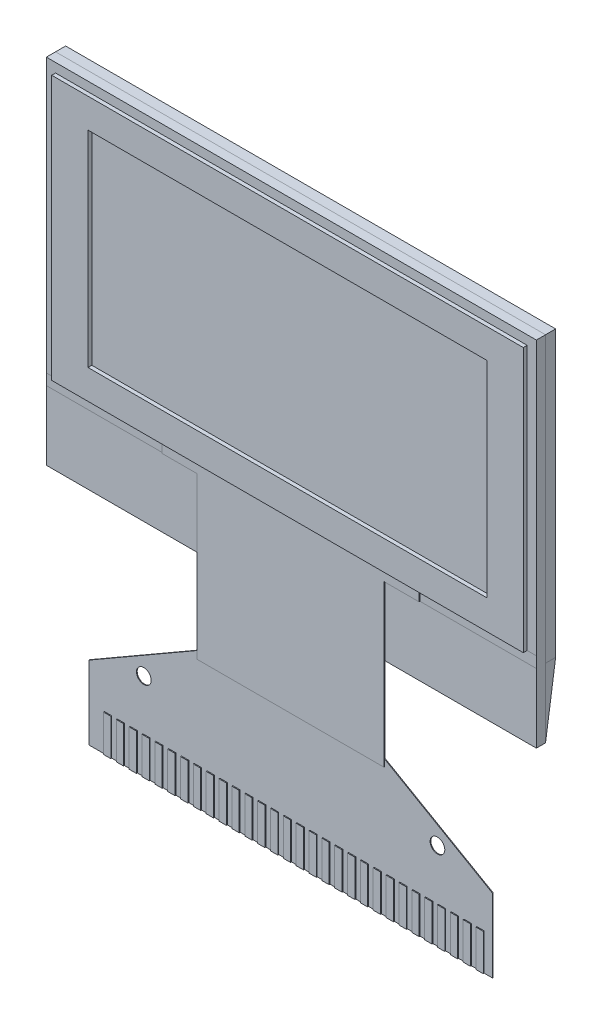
from build123d import *

# Parameters (mm, degrees)
SKETCH1_W              = 26.7
SKETCH1_H              = 19.26
BOSS_EXTRUDE2_DEPTH    = 0.5
SKETCH2_R              = 0.4
BOSS_EXTRUDE3_DEPTH    = 0.04
BOSS_EXTRUDE5_DEPTH    = 0.05
SKETCH3_W              = 0.4
SKETCH3_H              = 2
BOSS_EXTRUDE4_DEPTH    = 0.05
BOSS_EXTRUDE4_2_DEPTH  = 0.05
BOSS_EXTRUDE4_3_DEPTH  = 0.05
BOSS_EXTRUDE4_4_DEPTH  = 0.05
BOSS_EXTRUDE4_5_DEPTH  = 0.05
BOSS_EXTRUDE4_6_DEPTH  = 0.05
BOSS_EXTRUDE4_7_DEPTH  = 0.05
BOSS_EXTRUDE4_8_DEPTH  = 0.05
BOSS_EXTRUDE4_9_DEPTH  = 0.05
BOSS_EXTRUDE4_10_DEPTH = 0.05
BOSS_EXTRUDE4_11_DEPTH = 0.05
BOSS_EXTRUDE4_12_DEPTH = 0.05
BOSS_EXTRUDE4_13_DEPTH = 0.05
BOSS_EXTRUDE4_14_DEPTH = 0.05
BOSS_EXTRUDE4_15_DEPTH = 0.05
BOSS_EXTRUDE4_16_DEPTH = 0.05
BOSS_EXTRUDE4_17_DEPTH = 0.05
BOSS_EXTRUDE4_18_DEPTH = 0.05
BOSS_EXTRUDE4_19_DEPTH = 0.05
BOSS_EXTRUDE4_20_DEPTH = 0.05
BOSS_EXTRUDE4_21_DEPTH = 0.05
BOSS_EXTRUDE4_22_DEPTH = 0.05
BOSS_EXTRUDE4_23_DEPTH = 0.05
BOSS_EXTRUDE4_24_DEPTH = 0.05
BOSS_EXTRUDE4_25_DEPTH = 0.05
BOSS_EXTRUDE4_26_DEPTH = 0.05
BOSS_EXTRUDE4_27_DEPTH = 0.05
BOSS_EXTRUDE4_28_DEPTH = 0.05
BOSS_EXTRUDE4_29_DEPTH = 0.05
BOSS_EXTRUDE4_30_DEPTH = 0.05
BOSS_EXTRUDE6_START    = 0.5
SKETCH1_6_W            = 25.7
SKETCH1_6_H            = 14.4
SKETCH1_6_W_2          = 21.744
SKETCH1_6_H_2          = 11.204
BOSS_EXTRUDE6_DEPTH    = 0.21
SKETCH1_7_W            = 25.7
SKETCH1_7_H            = 14.4
SKETCH1_7_W_2          = 23.744
SKETCH1_7_H_2          = 13.204
SKETCH1_7_W_3          = 21.744
SKETCH1_7_H_3          = 11.204
BOSS_EXTRUDE7_DEPTH    = 0.55
BOSS_EXTRUDE8_DEPTH    = 26.7


with BuildPart() as part:
    # Sketch1 → Boss-Extrude2 (new body)
    with BuildSketch(Plane.XY):
        with Locations((0, -1.93)):
            Rectangle(SKETCH1_W, SKETCH1_H)
    extrude(amount=BOSS_EXTRUDE2_DEPTH)


with BuildPart() as body_2:
    # Sketch2 → Boss-Extrude3 (new body)
    with BuildSketch(Plane.XY.offset(0.5)):
        Polygon((-5.105, -11.06), (-5.105, -16.16), (-11, -19.56), (-11, -23.56), (11, -23.56), (11, -19.56), (5.105, -16.16), (5.105, -11.06), align=None)
        with Locations((-8, -18.81)):
            Circle(SKETCH2_R, mode=Mode.SUBTRACT)
        with Locations((8, -18.81)):
            Circle(SKETCH2_R, mode=Mode.SUBTRACT)
    extrude(amount=BOSS_EXTRUDE3_DEPTH)


with BuildPart() as body_3:
    # Sketch4 → Boss-Extrude5 (new body)
    with BuildSketch(Plane.XY.offset(0.5)):
        Polygon((-7, -7.2), (7, -7.2), (7, -7.8), (5.105, -7.8), (5.105, -16.56), (-5.105, -16.56), (-5.105, -7.8), (-7, -7.8), align=None)
    extrude(amount=BOSS_EXTRUDE5_DEPTH)


with BuildPart() as body_4:
    # Sketch3 → Boss-Extrude4 (new body)
    with BuildSketch(Plane.XY.offset(0.54)):
        with Locations((-9.95, -22.56)):
            Rectangle(SKETCH3_W, SKETCH3_H)
    extrude(amount=BOSS_EXTRUDE4_DEPTH)


with BuildPart() as body_5:
    # Sketch3 → Boss-Extrude4 2 (new body)
    with BuildSketch(Plane.XY.offset(0.54)):
        with Locations((-9.25, -22.56)):
            Rectangle(SKETCH3_W, SKETCH3_H)
    extrude(amount=BOSS_EXTRUDE4_2_DEPTH)


with BuildPart() as body_6:
    # Sketch3 → Boss-Extrude4 3 (new body)
    with BuildSketch(Plane.XY.offset(0.54)):
        with Locations((-8.55, -22.56)):
            Rectangle(SKETCH3_W, SKETCH3_H)
    extrude(amount=BOSS_EXTRUDE4_3_DEPTH)


with BuildPart() as body_7:
    # Sketch3 → Boss-Extrude4 4 (new body)
    with BuildSketch(Plane.XY.offset(0.54)):
        with Locations((-7.85, -22.56)):
            Rectangle(SKETCH3_W, SKETCH3_H)
    extrude(amount=BOSS_EXTRUDE4_4_DEPTH)


with BuildPart() as body_8:
    # Sketch3 → Boss-Extrude4 5 (new body)
    with BuildSketch(Plane.XY.offset(0.54)):
        with Locations((-7.15, -22.56)):
            Rectangle(SKETCH3_W, SKETCH3_H)
    extrude(amount=BOSS_EXTRUDE4_5_DEPTH)


with BuildPart() as body_9:
    # Sketch3 → Boss-Extrude4 6 (new body)
    with BuildSketch(Plane.XY.offset(0.54)):
        with Locations((-6.45, -22.56)):
            Rectangle(SKETCH3_W, SKETCH3_H)
    extrude(amount=BOSS_EXTRUDE4_6_DEPTH)


with BuildPart() as body_10:
    # Sketch3 → Boss-Extrude4 7 (new body)
    with BuildSketch(Plane.XY.offset(0.54)):
        with Locations((-5.75, -22.56)):
            Rectangle(SKETCH3_W, SKETCH3_H)
    extrude(amount=BOSS_EXTRUDE4_7_DEPTH)


with BuildPart() as body_11:
    # Sketch3 → Boss-Extrude4 8 (new body)
    with BuildSketch(Plane.XY.offset(0.54)):
        with Locations((-5.05, -22.56)):
            Rectangle(SKETCH3_W, SKETCH3_H)
    extrude(amount=BOSS_EXTRUDE4_8_DEPTH)


with BuildPart() as body_12:
    # Sketch3 → Boss-Extrude4 9 (new body)
    with BuildSketch(Plane.XY.offset(0.54)):
        with Locations((-4.35, -22.56)):
            Rectangle(SKETCH3_W, SKETCH3_H)
    extrude(amount=BOSS_EXTRUDE4_9_DEPTH)


with BuildPart() as body_13:
    # Sketch3 → Boss-Extrude4 10 (new body)
    with BuildSketch(Plane.XY.offset(0.54)):
        with Locations((-3.65, -22.56)):
            Rectangle(SKETCH3_W, SKETCH3_H)
    extrude(amount=BOSS_EXTRUDE4_10_DEPTH)


with BuildPart() as body_14:
    # Sketch3 → Boss-Extrude4 11 (new body)
    with BuildSketch(Plane.XY.offset(0.54)):
        with Locations((-2.95, -22.56)):
            Rectangle(SKETCH3_W, SKETCH3_H)
    extrude(amount=BOSS_EXTRUDE4_11_DEPTH)


with BuildPart() as body_15:
    # Sketch3 → Boss-Extrude4 12 (new body)
    with BuildSketch(Plane.XY.offset(0.54)):
        with Locations((-2.25, -22.56)):
            Rectangle(SKETCH3_W, SKETCH3_H)
    extrude(amount=BOSS_EXTRUDE4_12_DEPTH)


with BuildPart() as body_16:
    # Sketch3 → Boss-Extrude4 13 (new body)
    with BuildSketch(Plane.XY.offset(0.54)):
        with Locations((-1.55, -22.56)):
            Rectangle(SKETCH3_W, SKETCH3_H)
    extrude(amount=BOSS_EXTRUDE4_13_DEPTH)


with BuildPart() as body_17:
    # Sketch3 → Boss-Extrude4 14 (new body)
    with BuildSketch(Plane.XY.offset(0.54)):
        with Locations((-0.85, -22.56)):
            Rectangle(SKETCH3_W, SKETCH3_H)
    extrude(amount=BOSS_EXTRUDE4_14_DEPTH)


with BuildPart() as body_18:
    # Sketch3 → Boss-Extrude4 15 (new body)
    with BuildSketch(Plane.XY.offset(0.54)):
        with Locations((-0.15, -22.56)):
            Rectangle(SKETCH3_W, SKETCH3_H)
    extrude(amount=BOSS_EXTRUDE4_15_DEPTH)


with BuildPart() as body_19:
    # Sketch3 → Boss-Extrude4 16 (new body)
    with BuildSketch(Plane.XY.offset(0.54)):
        with Locations((0.55, -22.56)):
            Rectangle(SKETCH3_W, SKETCH3_H)
    extrude(amount=BOSS_EXTRUDE4_16_DEPTH)


with BuildPart() as body_20:
    # Sketch3 → Boss-Extrude4 17 (new body)
    with BuildSketch(Plane.XY.offset(0.54)):
        with Locations((1.25, -22.56)):
            Rectangle(SKETCH3_W, SKETCH3_H)
    extrude(amount=BOSS_EXTRUDE4_17_DEPTH)


with BuildPart() as body_21:
    # Sketch3 → Boss-Extrude4 18 (new body)
    with BuildSketch(Plane.XY.offset(0.54)):
        with Locations((1.95, -22.56)):
            Rectangle(SKETCH3_W, SKETCH3_H)
    extrude(amount=BOSS_EXTRUDE4_18_DEPTH)


with BuildPart() as body_22:
    # Sketch3 → Boss-Extrude4 19 (new body)
    with BuildSketch(Plane.XY.offset(0.54)):
        with Locations((2.65, -22.56)):
            Rectangle(SKETCH3_W, SKETCH3_H)
    extrude(amount=BOSS_EXTRUDE4_19_DEPTH)


with BuildPart() as body_23:
    # Sketch3 → Boss-Extrude4 20 (new body)
    with BuildSketch(Plane.XY.offset(0.54)):
        with Locations((3.35, -22.56)):
            Rectangle(SKETCH3_W, SKETCH3_H)
    extrude(amount=BOSS_EXTRUDE4_20_DEPTH)


with BuildPart() as body_24:
    # Sketch3 → Boss-Extrude4 21 (new body)
    with BuildSketch(Plane.XY.offset(0.54)):
        with Locations((4.05, -22.56)):
            Rectangle(SKETCH3_W, SKETCH3_H)
    extrude(amount=BOSS_EXTRUDE4_21_DEPTH)


with BuildPart() as body_25:
    # Sketch3 → Boss-Extrude4 22 (new body)
    with BuildSketch(Plane.XY.offset(0.54)):
        with Locations((4.75, -22.56)):
            Rectangle(SKETCH3_W, SKETCH3_H)
    extrude(amount=BOSS_EXTRUDE4_22_DEPTH)


with BuildPart() as body_26:
    # Sketch3 → Boss-Extrude4 23 (new body)
    with BuildSketch(Plane.XY.offset(0.54)):
        with Locations((5.45, -22.56)):
            Rectangle(SKETCH3_W, SKETCH3_H)
    extrude(amount=BOSS_EXTRUDE4_23_DEPTH)


with BuildPart() as body_27:
    # Sketch3 → Boss-Extrude4 24 (new body)
    with BuildSketch(Plane.XY.offset(0.54)):
        with Locations((6.15, -22.56)):
            Rectangle(SKETCH3_W, SKETCH3_H)
    extrude(amount=BOSS_EXTRUDE4_24_DEPTH)


with BuildPart() as body_28:
    # Sketch3 → Boss-Extrude4 25 (new body)
    with BuildSketch(Plane.XY.offset(0.54)):
        with Locations((6.85, -22.56)):
            Rectangle(SKETCH3_W, SKETCH3_H)
    extrude(amount=BOSS_EXTRUDE4_25_DEPTH)


with BuildPart() as body_29:
    # Sketch3 → Boss-Extrude4 26 (new body)
    with BuildSketch(Plane.XY.offset(0.54)):
        with Locations((7.55, -22.56)):
            Rectangle(SKETCH3_W, SKETCH3_H)
    extrude(amount=BOSS_EXTRUDE4_26_DEPTH)


with BuildPart() as body_30:
    # Sketch3 → Boss-Extrude4 27 (new body)
    with BuildSketch(Plane.XY.offset(0.54)):
        with Locations((8.25, -22.56)):
            Rectangle(SKETCH3_W, SKETCH3_H)
    extrude(amount=BOSS_EXTRUDE4_27_DEPTH)


with BuildPart() as body_31:
    # Sketch3 → Boss-Extrude4 28 (new body)
    with BuildSketch(Plane.XY.offset(0.54)):
        with Locations((8.95, -22.56)):
            Rectangle(SKETCH3_W, SKETCH3_H)
    extrude(amount=BOSS_EXTRUDE4_28_DEPTH)


with BuildPart() as body_32:
    # Sketch3 → Boss-Extrude4 29 (new body)
    with BuildSketch(Plane.XY.offset(0.54)):
        with Locations((9.65, -22.56)):
            Rectangle(SKETCH3_W, SKETCH3_H)
    extrude(amount=BOSS_EXTRUDE4_29_DEPTH)


with BuildPart() as body_33:
    # Sketch3 → Boss-Extrude4 30 (new body)
    with BuildSketch(Plane.XY.offset(0.54)):
        with Locations((10.35, -22.56)):
            Rectangle(SKETCH3_W, SKETCH3_H)
    extrude(amount=BOSS_EXTRUDE4_30_DEPTH)


with BuildPart() as body_34:
    # Sketch1_6 → Boss-Extrude6 (new body)
    with BuildSketch(Plane.XY.offset(BOSS_EXTRUDE6_START)):
        Rectangle(SKETCH1_6_W, SKETCH1_6_H)
        Rectangle(SKETCH1_6_W_2, SKETCH1_6_H_2, mode=Mode.SUBTRACT)
    extrude(amount=BOSS_EXTRUDE6_DEPTH)


with BuildPart() as body_35:
    # Sketch1_7 → Boss-Extrude7 (new body)
    # profile 1 of 5: a face of its own
    with BuildSketch(Plane.XY):
        Polygon((-12.85, -7.2), (-13.35, -7.2), (-13.35, -7.8), (13.35, -7.8), (13.35, -7.2), (12.85, -7.2), align=None)
    # profile 2 of 5: a face of its own
    with BuildSketch(Plane.XY):
        Rectangle(SKETCH1_7_W, SKETCH1_7_H)
        Rectangle(SKETCH1_7_W_2, SKETCH1_7_H_2, mode=Mode.SUBTRACT)
    # profile 3 of 5: a face of its own
    with BuildSketch(Plane.XY):
        Rectangle(SKETCH1_7_W_2, SKETCH1_7_H_2)
        Rectangle(SKETCH1_7_W_3, SKETCH1_7_H_3, mode=Mode.SUBTRACT)
    # profile 4 of 5: a face of its own
    with BuildSketch(Plane.XY):
        Rectangle(SKETCH1_7_W_3, SKETCH1_7_H_3)
    # profile 5 of 5: a face of its own
    with BuildSketch(Plane.XY):
        Polygon((-13.35, 7.7), (-13.35, -7.2), (-12.85, -7.2), (-12.85, 7.2), (12.85, 7.2), (12.85, -7.2), (13.35, -7.2), (13.35, 7.7), align=None)
    extrude(amount=-BOSS_EXTRUDE7_DEPTH)


with BuildPart() as body_36:
    # Sketch5 → Boss-Extrude8 (new body)
    with BuildSketch(Plane(origin=(13.35, 0, 0), x_dir=(0, 0, -1), z_dir=(1, 0, 0))):
        Polygon((0, -11.56), (0.55, -7.8), (0, -7.8), align=None)
    extrude(amount=-BOSS_EXTRUDE8_DEPTH)


solid = Compound([part.part, body_2.part, body_3.part, body_4.part, body_5.part, body_6.part, body_7.part, body_8.part, body_9.part, body_10.part, body_11.part, body_12.part, body_13.part, body_14.part, body_15.part, body_16.part, body_17.part, body_18.part, body_19.part, body_20.part, body_21.part, body_22.part, body_23.part, body_24.part, body_25.part, body_26.part, body_27.part, body_28.part, body_29.part, body_30.part, body_31.part, body_32.part, body_33.part, body_34.part, body_35.part, body_36.part])
